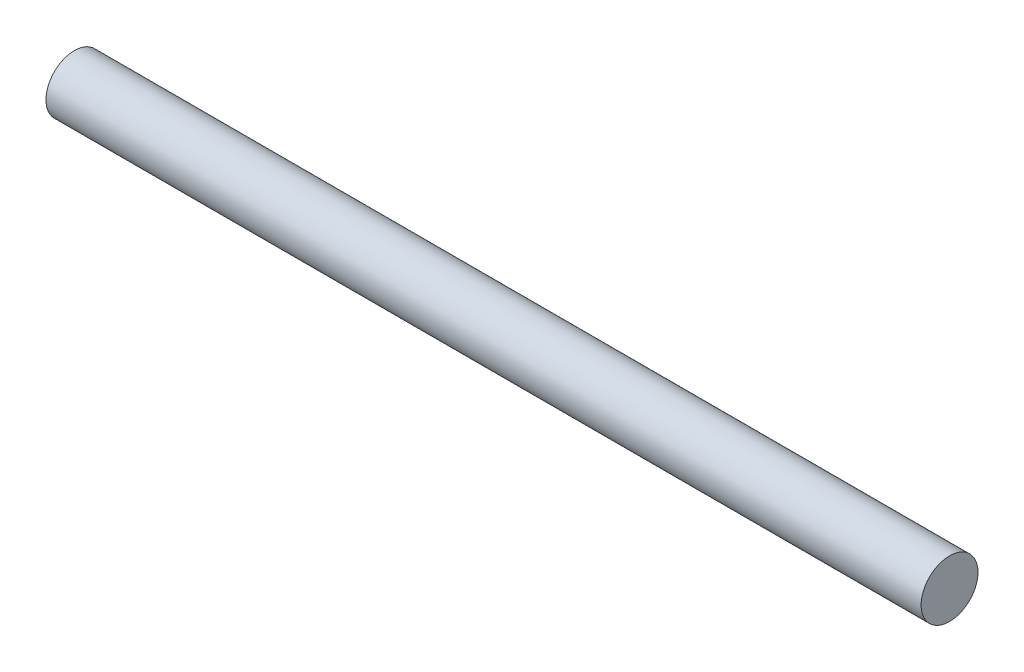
from build123d import *

# Parameters (mm, degrees)
SKETCH1_R           = 1.651
BOSS_EXTRUDE1_DEPTH = 50.8


with BuildPart() as part:
    # Sketch1 → Boss-Extrude1 (new body)
    with BuildSketch(Plane(origin=(0, 0, 0), x_dir=(0, 0, -1), z_dir=(1, 0, 0))):
        Circle(SKETCH1_R)
    extrude(amount=BOSS_EXTRUDE1_DEPTH)


solid = part.part
